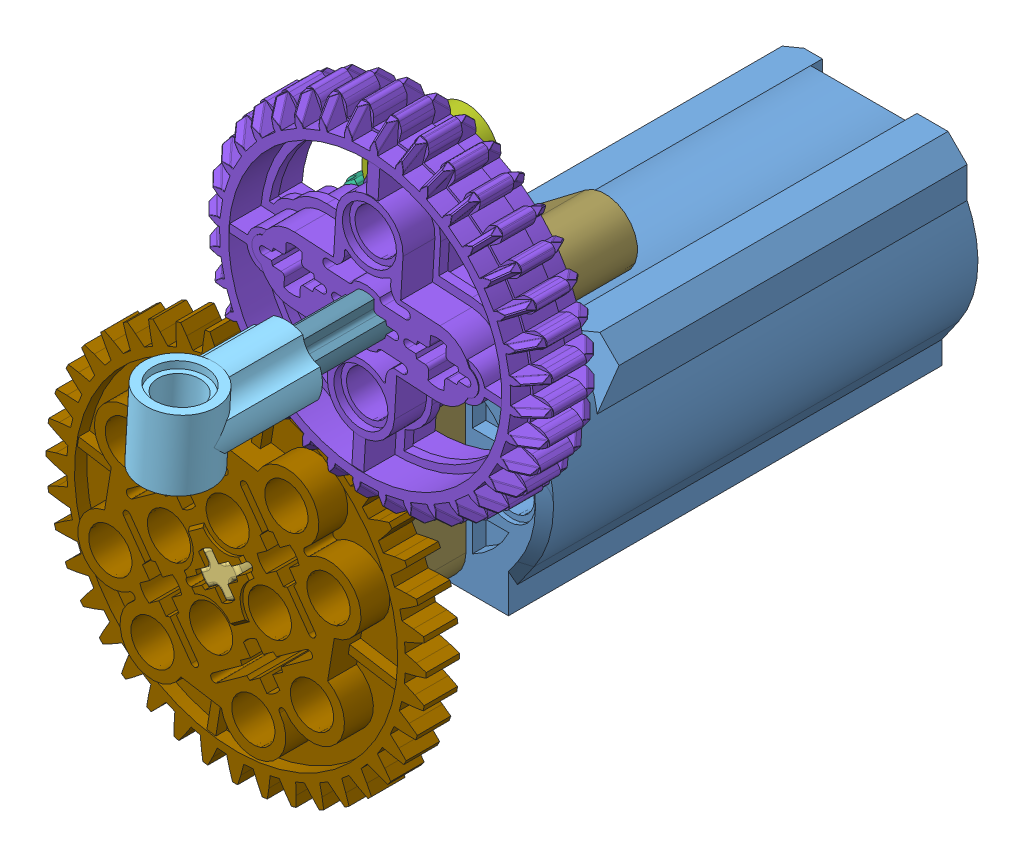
SolidWorks assembly 49.SLDASM, configuration 기본 (file format 9000). Lengths in mm.
Overall size (65.68 82.33 97.1).
16 component instances, 14 part files, 41 mates.
Components (placement in the parent):
- 9V Motor M-1: 9V Motor M.SLDPRT [기본] at (3.3865 1.39 48.1336) size (24 24 48.27)
- 2780 Pin with Friction Ridges Lengthwise WITH Center Slots-1: 2780 Pin with Friction Ridges Lengthwise WITH Center Slots.SLDPRT [기본] at (9.6495 22.2323 80.4336) x (1 0 0) z (0 1 0) size (6 16 5.88)
- 3705 Axle 4-1: 3705 Axle 4.SLDPRT [기본] at (3.3865 1.39 96.1336) x (0.583425 -0.812167 0) z (0.812167 0.583425 0) size (4.8 32.01 4.8)
- 3713 Bush-1: 3713 Bush.SLDPRT [기본] at (3.3865 1.39 84.4336) x (0.583425 -0.812167 0) z (0.812167 0.583425 0) size (7.2 8.01 7.2)
- 32013 Axle pin connector angled #1-1: 32013 Axle pin connector angled #1.SLDPRT [기본] at (19.8879 34.5407 105.2336) x (0 0 -1) z (0.058932 0.998262 0) size (16 8 8)
- 32062 Axle 2 Notched-1: 32062 Axle 2 Notched.SLDPRT [기본] at (17.8782 23.9671 84.4336) x (0.795995 0.605303 0) z (0 0 1) size (4.8 16.01 4.8)
- 32291 Axle and Pin Connector Perpendicular Double-1: 32291 Axle and Pin Connector Perpendicular Double.SLDPRT [기본] at (15.0455 40.9086 84.4336) x (0.605303 -0.795995 0) z (-0.795995 -0.605303 0) size (15.2 8 15.2)
- 32498 Gear 36 double bevel-1: 32498 Gear 36 double bevel.SLDPRT [기본] at (19.8879 34.5407 92.4661) x (0.058932 0.998262 0) z (0.998262 -0.058932 0) size (37.47 8.22 37.47)
- 3649 Gear 40 _-1: 3649 Gear 40 _.SLDPRT [기본] at (3.3865 1.39 92.4336) x (0.583425 -0.812167 0) z (0.812167 0.583425 0) size (42.1 8 42.1)
- 42003 Axle and Pin Connector Perpendicular 3L with 2 Pin Holes-1: 42003 Axle and Pin Connector Perpendicular 3L with 2 Pin Holes.SLDPRT [기본] at (9.6495 22.2323 84.4336) x (-0.795995 -0.605303 0) z (-0.605303 0.795995 0) size (23.2 8 7.2)
- 2780 Pin with Friction Ridges Lengthwise WITH Center Slots-2: 2780 Pin with Friction Ridges Lengthwise WITH Center Slots.SLDPRT [기본] at (3.3165 9.39 72.4336) x (1 0 0) z (0 1 0) size (6 16 5.88)
- 2780 Pin with Friction Ridges Lengthwise WITH Center Slots-3: 2780 Pin with Friction Ridges Lengthwise WITH Center Slots.SLDPRT [기본] at (3.2815 17.3899 80.4336) x (1 0 0) z (0 1 0) size (6 16 5.88)
- Motor 9V  PF Medium part-2: Motor 9V  PF Medium part.SLDPRT [기본] at (4.1088 -0.543 64.1336) x (0.583425 -0.812167 0) z (0 0 1) size (7 7 8)
- 32348 Liftarm 1 x 7 Bent (4 - 4) Thick-1: 32348 Liftarm 1 x 7 Bent (4 - 4) Thick.SLDPRT [기본] at (3.2815 17.3899 76.4336) x (0.004375 -0.99999 0) z (-0.99999 -0.004375 0) size (45.64 8 26.37)
- 43093 Axle Pin with Friction Ridges Lengthwise-1: 43093 Axle Pin with Friction Ridges Lengthwise.SLDPRT [기본] at (3.3865 -6.61 72.4336) x (0.99999 0.004375 0) z (0.004375 -0.99999 0) size (6 16 6)
- 87083 Axle 4 w stop-1: 87083 Axle 4 w stop.SLDPRT [기본] at (19.8879 34.5407 81.2336) x (0.058932 0.998262 0) z (0.998262 -0.058932 0) size (6 32.8 6)
Mates (geometry in assembly coordinates):
- 동심1: concentric: cylinder of 9V Motor M-1 through (3.3865 1.39 72.1336) axis (0 0 1) radius 3.505; cylinder of Motor 9V  PF Medium part-2 through (3.3865 1.39 72.1336) axis (0 0 -1) radius 3.5
- 일치1: coincident: plane of 9V Motor M-1 through (3.3865 1.39 72.1336) normal (0 0 1); plane of Motor 9V  PF Medium part-2 through (3.3865 1.39 72.1336) normal (0 0 1)
- 동심2: concentric: cylinder of 3705 Axle 4-1 through (3.3865 1.39 64.1336) axis (0 0 1) radius 2.4; cylinder of Motor 9V  PF Medium part-2 through (3.3865 1.39 72.1336) axis (0 0 -1) radius 2.4
- 일치2: coincident: plane of 3705 Axle 4-1 through (5.7772 1.178 64.1336) normal (0.447431 0.894318 0); plane of Motor 9V  PF Medium part-2 through (5.7772 1.178 72.1336) normal (-0.447431 -0.894318 0)
- 일치3: coincident: plane of 3705 Axle 4-1 through (3.3865 1.39 64.1336) normal (0 0 -1); circle of Motor 9V  PF Medium part-2
- 동심3: concentric: cylinder of 9V Motor M-1 through (3.3165 9.39 72.1336) axis (0 0 1) radius 2.4; cylinder of 2780 Pin with Friction Ridges Lengthwise WITH Center Slots-2 through (3.3165 9.39 80.4336) axis (0 0 -1) radius 2.4
- 일치4: coincident: plane of 9V Motor M-1 through (5.7165 9.39 71.6336) normal (0 0 1); plane of 2780 Pin with Friction Ridges Lengthwise WITH Center Slots-2 through (3.3165 9.39 71.6336) normal (0 0 -1)
- 동심5: concentric: cylinder of 9V Motor M-1 through (3.3865 -6.61 72.1336) axis (0 0 1) radius 2.4; cylinder of 43093 Axle Pin with Friction Ridges Lengthwise-1 through (3.3865 -6.61 64.4336) axis (0 0 1) radius 2.4
- 일치5: coincident: plane of 9V Motor M-1 through (5.7865 -6.61 71.6336) normal (0 0 1); plane of 43093 Axle Pin with Friction Ridges Lengthwise-1 through (3.3865 -6.61 71.6336) normal (0 0 -1)
- 동심6: concentric: cylinder of 32348 Liftarm 1 x 7 Bent (4 - 4) Thick-1 through (3.3865 -6.6098 72.4336) axis (0 0 1) radius 2.4; cylinder of 43093 Axle Pin with Friction Ridges Lengthwise-1 through (3.3865 -6.61 80.4336) axis (0 0 -1) radius 2.4
- 일치6: coincident: plane of 32348 Liftarm 1 x 7 Bent (4 - 4) Thick-1 through (4.2721 -7.886 72.4336) normal (-0.99999 -0.004375 0); plane of 43093 Axle Pin with Friction Ridges Lengthwise-1 through (4.2763 -8.839 80.4336) normal (0.99999 0.004375 0)
- 동심7: concentric: cylinder of 2780 Pin with Friction Ridges Lengthwise WITH Center Slots-2 through (3.3165 9.39 80.4336) axis (0 0 -1) radius 2.4; cylinder of 32348 Liftarm 1 x 7 Bent (4 - 4) Thick-1 through (3.3165 9.39 72.4336) axis (0 0 1) radius 2.4
- 일치7: coincident: plane of 2780 Pin with Friction Ridges Lengthwise WITH Center Slots-2 through (3.3165 9.39 73.2336) normal (0 0 1); plane of 32348 Liftarm 1 x 7 Bent (4 - 4) Thick-1 through (3.3165 9.39 73.2336) normal (0 0 -1)
- 동심8: concentric: cylinder of 2780 Pin with Friction Ridges Lengthwise WITH Center Slots-3 through (3.2815 17.3899 88.4336) axis (0 0 -1) radius 2.4; cylinder of 32348 Liftarm 1 x 7 Bent (4 - 4) Thick-1 through (3.2815 17.3899 72.4336) axis (0 0 1) radius 2.4
- 일치8: coincident: plane of 2780 Pin with Friction Ridges Lengthwise WITH Center Slots-3 through (3.2815 17.3899 79.6336) normal (0 0 -1); plane of 32348 Liftarm 1 x 7 Bent (4 - 4) Thick-1 through (3.2815 17.3899 79.6336) normal (0 0 1)
- 동심9: concentric: cylinder of 2780 Pin with Friction Ridges Lengthwise WITH Center Slots-1 through (9.6495 22.2323 88.4336) axis (0 0 -1) radius 2.4; cylinder of 32348 Liftarm 1 x 7 Bent (4 - 4) Thick-1 through (9.6495 22.2323 72.4336) axis (0 0 1) radius 2.4
- 일치9: coincident: plane of 2780 Pin with Friction Ridges Lengthwise WITH Center Slots-1 through (9.6495 22.2323 79.6336) normal (0 0 -1); plane of 32348 Liftarm 1 x 7 Bent (4 - 4) Thick-1 through (9.6495 22.2323 79.6336) normal (0 0 1)
- 동심10: concentric: cylinder of 3705 Axle 4-1 through (3.3865 1.39 64.1336) axis (0 0 1) radius 2.4; cylinder of 3713 Bush-1 through (3.3865 1.39 88.4336) axis (0 0 -1) radius 2.4
- 일치10: coincident: plane of 3705 Axle 4-1 through (0.9959 1.602 64.1336) normal (-0.447431 -0.894318 0); plane of 3713 Bush-1 through (1.8481 1.1757 88.4336) normal (0.447431 0.894318 0)
- 일치11: coincident: plane of 3713 Bush-1 through (3.3865 1.39 80.4336) normal (0 0 -1); plane of 32348 Liftarm 1 x 7 Bent (4 - 4) Thick-1 through (3.3865 -6.6098 80.4336) normal (0 0 1)
- 동심11: concentric: cylinder of 42003 Axle and Pin Connector Perpendicular 3L with 2 Pin Holes-1 through (3.2815 17.3899 80.4336) axis (0 0 1) radius 2.4; cylinder of 2780 Pin with Friction Ridges Lengthwise WITH Center Slots-3 through (3.2815 17.3899 88.4336) axis (0 0 -1) radius 2.4
- 동심12: concentric: cylinder of 2780 Pin with Friction Ridges Lengthwise WITH Center Slots-1 through (9.6495 22.2323 88.4336) axis (0 0 -1) radius 2.4; cylinder of 42003 Axle and Pin Connector Perpendicular 3L with 2 Pin Holes-1 through (9.6495 22.2323 80.4336) axis (0 0 1) radius 2.4
- 일치12: coincident: plane of 2780 Pin with Friction Ridges Lengthwise WITH Center Slots-1 through (9.6495 22.2323 81.2336) normal (0 0 1); plane of 42003 Axle and Pin Connector Perpendicular 3L with 2 Pin Holes-1 through (9.6495 22.2323 81.2336) normal (0 0 -1)
- 동심13: concentric: cylinder of 32062 Axle 2 Notched-1 through (8.1933 36.703 84.4336) axis (0.605303 -0.795995 0) radius 2.4; cylinder of 42003 Axle and Pin Connector Perpendicular 3L with 2 Pin Holes-1 through (17.8782 23.9671 84.4336) axis (-0.605303 0.795995 0) radius 2.4
- 평행1: parallel: plane of 32062 Axle 2 Notched-1 through (8.8938 37.2357 86.6664) normal (0.795995 0.605303 0); plane of 42003 Axle and Pin Connector Perpendicular 3L with 2 Pin Holes-1 through (18.5822 24.5024 85.0647) normal (-0.795995 -0.605303 0)
- 일치14: coincident: plane of 32062 Axle 2 Notched-1 through (17.8782 23.9671 84.4336) normal (0.605303 -0.795995 0); plane of 42003 Axle and Pin Connector Perpendicular 3L with 2 Pin Holes-1 through (18.1965 24.2092 88.4336) normal (0.605303 -0.795995 0)
- 동심14: concentric: cylinder of 32062 Axle 2 Notched-1 through (8.1933 36.703 84.4336) axis (0.605303 -0.795995 0) radius 2.4; cylinder of 32291 Axle and Pin Connector Perpendicular Double-1 through (6.4985 38.9318 84.4336) axis (0.605303 -0.795995 0) radius 2.4
- 일치15: coincident: plane of 32062 Axle 2 Notched-1 through (8.8938 37.2357 83.5536) normal (0 0 -1); plane of 32291 Axle and Pin Connector Perpendicular Double-1 through (7.5173 39.7066 83.5536) normal (0 0 1)
- 일치16: coincident: plane of 32291 Axle and Pin Connector Perpendicular Double-1 through (17.0223 32.3616 80.8336) normal (0.605303 -0.795995 0); plane of 42003 Axle and Pin Connector Perpendicular 3L with 2 Pin Holes-1 through (13.8384 29.9404 88.4336) normal (-0.605303 0.795995 0)
- 동심15: concentric: cylinder of 32291 Axle and Pin Connector Perpendicular Double-1 through (19.8879 34.5407 80.4336) axis (0 0 1) radius 2.4; cylinder of 87083 Axle 4 w stop-1 through (19.8879 34.5407 113.2336) axis (0 0 -1) radius 2.4
- 일치17: coincident: plane of 32291 Axle and Pin Connector Perpendicular Double-1 through (19.8879 34.5407 81.2336) normal (0 0 -1); plane of 87083 Axle 4 w stop-1 through (19.8879 34.5407 81.2336) normal (0 0 1)
- 동심16: concentric: cylinder of 3705 Axle 4-1 through (3.3865 1.39 64.1336) axis (0 0 1) radius 2.4; cylinder of 3649 Gear 40 _-1 through (3.3865 1.39 96.4336) axis (0 0 -1) radius 2.4
- 일치18: coincident: plane of 3705 Axle 4-1 through (1.6005 -0.2131 64.1336) normal (-0.894318 0.447431 0); plane of 3649 Gear 40 _-1 through (1.6005 -0.2131 96.4336) normal (0.894318 -0.447431 0)
- 일치19: coincident: plane of 3713 Bush-1 through (3.3865 1.39 88.4336) normal (0 0 1); plane of 3649 Gear 40 _-1 through (5.1741 -3.977 88.4336) normal (0 0 -1)
- 동심17: concentric: cylinder of 32498 Gear 36 double bevel-1 through (19.8879 34.5407 79.5796) axis (0 0 1) radius 2.4; cylinder of 87083 Axle 4 w stop-1 through (19.8879 34.5407 113.2336) axis (0 0 -1) radius 2.4
- 일치20: coincident: plane of 32498 Gear 36 double bevel-1 through (20.3963 36.0084 79.5796) normal (0.593224 -0.805037 0); plane of 87083 Axle 4 w stop-1 through (20.0743 35.7711 113.2336) normal (-0.593224 0.805037 0)
- 일치21: coincident: plane of 32291 Axle and Pin Connector Perpendicular Double-1 through (15.0455 40.9086 88.4336) normal (0 0 1); plane of 32498 Gear 36 double bevel-1 through (17.7697 16.7355 88.4336) normal (0 0 -1)
- 동심18: concentric: cylinder of 32013 Axle pin connector angled #1-1 through (19.8879 34.5407 121.2346) axis (0 0 -1) radius 2.4; cylinder of 87083 Axle 4 w stop-1 through (19.8879 34.5407 113.2336) axis (0 0 -1) radius 2.4
- 일치22: coincident: plane of 32013 Axle pin connector angled #1-1 through (21.1634 36.5737 121.2346) normal (0.593224 -0.805037 0); plane of 87083 Axle 4 w stop-1 through (20.0743 35.7711 113.2336) normal (-0.593224 0.805037 0)
- 탄젠트1: tangent: cylinder of 32013 Axle pin connector angled #1-1 through (16.6678 32.1678 117.2336) axis (0.805037 0.593224 0) radius 4; plane of 87083 Axle 4 w stop-1 through (19.8879 34.5407 113.2336) normal (0 0 1)
- 기어 메이트1: gear = 32.8 mm: cylinder of 3649 Gear 40 _-1 through (3.3865 1.39 94.2886) axis (0 0 -1) radius 18.75; cylinder of 32498 Gear 36 double bevel-1 through (19.8879 34.5407 90.6111) axis (0 0 1) radius 16.4
